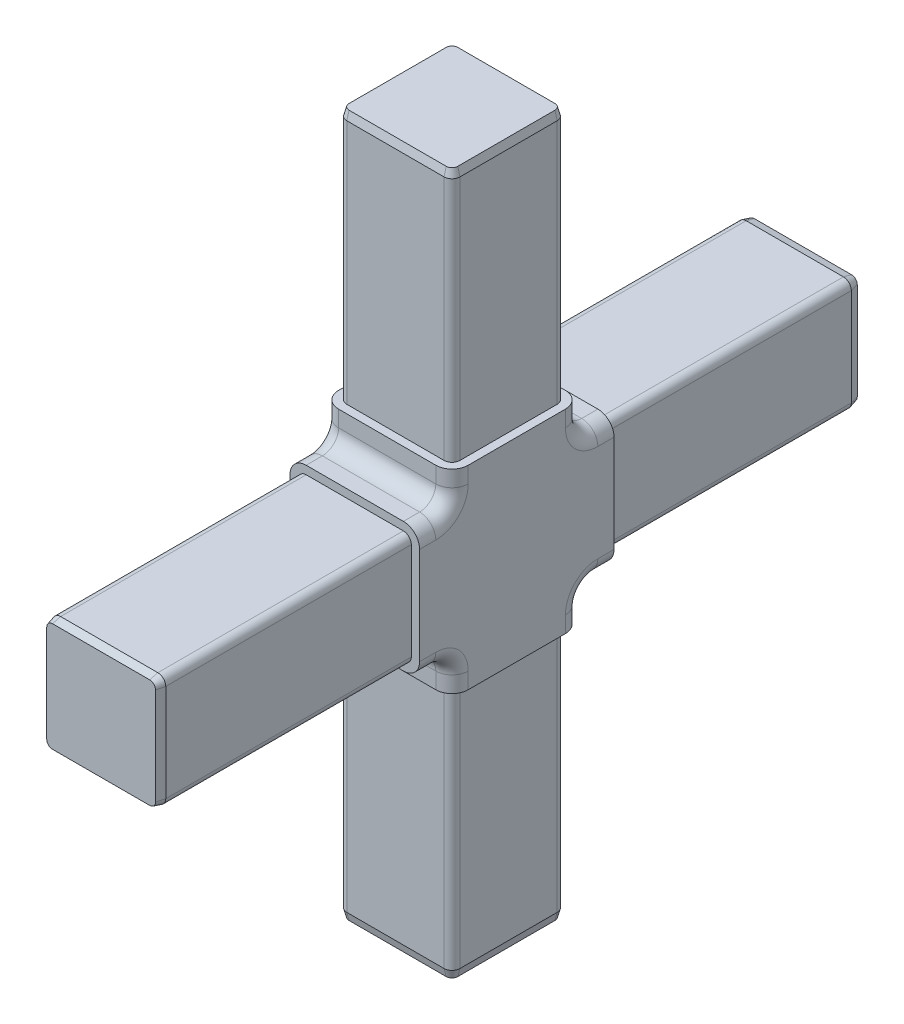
from build123d import *
from OCP.BRepFilletAPI import BRepFilletAPI_MakeChamfer

# Parameters (mm, degrees)
SKETCH5_W           = 203.2
SKETCH5_H           = 203.2
BOSS_EXTRUDE1_DEPTH = 550
SKETCH6_W           = 203.2
SKETCH6_H           = 203.2
BOSS_EXTRUDE2_DEPTH = 550
SKETCH7_W           = 377.884669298
SKETCH7_H           = 283.555750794
CUT_EXTRUDE1_DEPTH  = 898.879902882
SKETCH8_W           = 333.615448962
SKETCH8_H           = 339.173536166
CUT_EXTRUDE2_DEPTH  = 898.879902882
SKETCH9_W           = 367.625310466
SKETCH9_H           = 483.870467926
CUT_EXTRUDE3_DEPTH  = 898.879902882
SKETCH10_W          = 309.502731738
SKETCH10_H          = 361.813052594
CUT_EXTRUDE4_DEPTH  = 898.879902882
FILLET1_R           = 25.4
CHAMFER1_SIZE       = 12.7
CHAMFER1_SIZE2      = 3.402954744
CHAMFER2_SIZE       = 12.7
CHAMFER2_SIZE2      = 3.402954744


with BuildPart() as part:
    # Sketch5 → Boss-Extrude1 (new, symmetric)
    with BuildSketch(Plane(origin=(0, 0, 0), x_dir=(0, 1, 0), z_dir=(0, 0, 1))):
        Rectangle(SKETCH5_W, SKETCH5_H)
    extrude(amount=BOSS_EXTRUDE1_DEPTH, both=True)

    # Sketch6 → Boss-Extrude2 (add, symmetric)
    with BuildSketch(Plane(origin=(0, 0, 0), x_dir=(-1, 0, 0), z_dir=(0, 1, 0))):
        Rectangle(SKETCH6_W, SKETCH6_H)
    extrude(amount=BOSS_EXTRUDE2_DEPTH, both=True)

    # Sketch7 → Cut-Extrude1 (cut, through all)
    with BuildSketch(Plane(origin=(0, 152.4, 0), x_dir=(-1, 0, 0), z_dir=(0, 1, 0))):
        Rectangle(SKETCH7_W, SKETCH7_H)
        with BuildLine():
            Line((-88.646, 76.2), (-88.646, -76.2))
            ThreePointArc((-88.646, -76.2), (-85.000650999, -85.000650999), (-76.2, -88.646))
            Line((-76.2, -88.646), (76.2, -88.646))
            ThreePointArc((76.2, -88.646), (85.000650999, -85.000650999), (88.646, -76.2))
            Line((88.646, -76.2), (88.646, 76.2))
            ThreePointArc((88.646, 76.2), (85.000650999, 85.000650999), (76.2, 88.646))
            Line((76.2, 88.646), (-76.2, 88.646))
            ThreePointArc((-76.2, 88.646), (-85.000650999, 85.000650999), (-88.646, 76.2))
        make_face(mode=Mode.SUBTRACT)
    extrude(amount=CUT_EXTRUDE1_DEPTH, mode=Mode.SUBTRACT)

    # Sketch8 → Cut-Extrude2 (cut, through all)
    with BuildSketch(Plane(origin=(0, -152.4, 0), x_dir=(-1, 0, 0), z_dir=(0, 1, 0))):
        Rectangle(SKETCH8_W, SKETCH8_H)
        with BuildLine():
            Line((88.646, -76.2), (88.646, 76.2))
            ThreePointArc((88.646, 76.2), (85.000650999, 85.000650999), (76.2, 88.646))
            Line((76.2, 88.646), (-76.2, 88.646))
            ThreePointArc((-76.2, 88.646), (-85.000650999, 85.000650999), (-88.646, 76.2))
            Line((-88.646, 76.2), (-88.646, -76.2))
            ThreePointArc((-88.646, -76.2), (-85.000650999, -85.000650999), (-76.2, -88.646))
            Line((-76.2, -88.646), (76.2, -88.646))
            ThreePointArc((76.2, -88.646), (85.000650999, -85.000650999), (88.646, -76.2))
        make_face(mode=Mode.SUBTRACT)
    extrude(amount=-CUT_EXTRUDE2_DEPTH, mode=Mode.SUBTRACT)

    # Sketch9 → Cut-Extrude3 (cut, through all)
    with BuildSketch(Plane(origin=(0, 0, 152.4), x_dir=(0, 1, 0), z_dir=(0, 0, 1))):
        Rectangle(SKETCH9_W, SKETCH9_H)
        with BuildLine():
            Line((-88.646, 76.2), (-88.646, -76.2))
            ThreePointArc((-88.646, -76.2), (-85.000650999, -85.000650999), (-76.2, -88.646))
            Line((-76.2, -88.646), (76.2, -88.646))
            ThreePointArc((76.2, -88.646), (85.000650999, -85.000650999), (88.646, -76.2))
            Line((88.646, -76.2), (88.646, 76.2))
            ThreePointArc((88.646, 76.2), (85.000650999, 85.000650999), (76.2, 88.646))
            Line((76.2, 88.646), (-76.2, 88.646))
            ThreePointArc((-76.2, 88.646), (-85.000650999, 85.000650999), (-88.646, 76.2))
        make_face(mode=Mode.SUBTRACT)
    extrude(amount=CUT_EXTRUDE3_DEPTH, mode=Mode.SUBTRACT)

    # Sketch10 → Cut-Extrude4 (cut, through all)
    with BuildSketch(Plane(origin=(0, 0, -152.4), x_dir=(0, 1, 0), z_dir=(0, 0, 1))):
        Rectangle(SKETCH10_W, SKETCH10_H)
        with BuildLine():
            Line((-76.2, -88.646), (76.2, -88.646))
            ThreePointArc((76.2, -88.646), (85.000650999, -85.000650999), (88.646, -76.2))
            Line((88.646, -76.2), (88.646, 76.2))
            ThreePointArc((88.646, 76.2), (85.000650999, 85.000650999), (76.2, 88.646))
            Line((76.2, 88.646), (-76.2, 88.646))
            ThreePointArc((-76.2, 88.646), (-85.000650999, 85.000650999), (-88.646, 76.2))
            Line((-88.646, 76.2), (-88.646, -76.2))
            ThreePointArc((-88.646, -76.2), (-85.000650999, -85.000650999), (-76.2, -88.646))
        make_face(mode=Mode.SUBTRACT)
    extrude(amount=-CUT_EXTRUDE4_DEPTH, mode=Mode.SUBTRACT)

    # Fillet1
    fillet1_edges = [part.edges().sort_by_distance(p)[0] for p in [
        (101.6, -101.6, 127),
        (-101.6, -101.6, 127),
        (-101.6, 101.6, 127),
        (101.6, 101.6, 127),
        (101.6, 101.6, -127),
        (101.6, -101.6, -127),
        (-101.6, -101.6, -127),
        (-101.6, 101.6, -127),
        (-101.6, -127, -101.6),
        (101.6, -127, 101.6),
        (0, 101.6, 101.6),
        (0, -101.6, 101.6),
        (-101.6, -127, 101.6),
        (0, 101.6, -101.6),
        (0, -101.6, -101.6),
        (101.6, -127, -101.6),
        (101.6, 127, -101.6),
        (-101.6, 127, -101.6),
        (-101.6, 127, 101.6),
        (101.6, 127, 101.6),
    ]]
    fillet(fillet1_edges, radius=FILLET1_R)

    # Chamfer1: one chamfer whose edges measure the first distance from different faces: ONE call of the kernel's chamfer builder (chamfer() names one face for all edges)
    chamfer1_edges_1 = [part.edges().sort_by_distance(p)[0] for p in [
        (-85.000650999, -85.000650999, 550),
    ]]
    chamfer1_side_1 = [part.faces().sort_by_distance(p)[0] for p in [
        (-85.000650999, -85.000650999, 351.2),
    ]]
    chamfer1_edges_2 = [part.edges().sort_by_distance(p)[0] for p in [
        (0, -88.646, 550),
    ]]
    chamfer1_side_2 = [part.faces().sort_by_distance(p)[0] for p in [
        (0, -88.646, 351.2),
    ]]
    chamfer1_edges_3 = [part.edges().sort_by_distance(p)[0] for p in [
        (85.000650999, -85.000650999, 550),
    ]]
    chamfer1_side_3 = [part.faces().sort_by_distance(p)[0] for p in [
        (85.000650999, -85.000650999, 351.2),
    ]]
    chamfer1_edges_4 = [part.edges().sort_by_distance(p)[0] for p in [
        (88.646, 0, 550),
    ]]
    chamfer1_side_4 = [part.faces().sort_by_distance(p)[0] for p in [
        (88.646, 0, 351.2),
    ]]
    chamfer1_edges_5 = [part.edges().sort_by_distance(p)[0] for p in [
        (85.000650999, 85.000650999, 550),
    ]]
    chamfer1_side_5 = [part.faces().sort_by_distance(p)[0] for p in [
        (85.000650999, 85.000650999, 351.2),
    ]]
    chamfer1_edges_6 = [part.edges().sort_by_distance(p)[0] for p in [
        (0, 88.646, 550),
    ]]
    chamfer1_side_6 = [part.faces().sort_by_distance(p)[0] for p in [
        (0, 88.646, 351.2),
    ]]
    chamfer1_edges_7 = [part.edges().sort_by_distance(p)[0] for p in [
        (-85.000650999, 85.000650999, 550),
    ]]
    chamfer1_side_7 = [part.faces().sort_by_distance(p)[0] for p in [
        (-85.000650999, 85.000650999, 351.2),
    ]]
    chamfer1_edges_8 = [part.edges().sort_by_distance(p)[0] for p in [
        (-88.646, 0, 550),
    ]]
    chamfer1_side_8 = [part.faces().sort_by_distance(p)[0] for p in [
        (-88.646, 0, 351.2),
    ]]
    chamfer1_edges_9 = [part.edges().sort_by_distance(p)[0] for p in [
        (85.000650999, 550, 85.000650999),
    ]]
    chamfer1_side_9 = [part.faces().sort_by_distance(p)[0] for p in [
        (85.000650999, 351.2, 85.000650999),
    ]]
    chamfer1_edges_10 = [part.edges().sort_by_distance(p)[0] for p in [
        (88.646, 550, 0),
    ]]
    chamfer1_side_10 = [part.faces().sort_by_distance(p)[0] for p in [
        (88.646, 351.2, 0),
    ]]
    chamfer1_edges_11 = [part.edges().sort_by_distance(p)[0] for p in [
        (85.000650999, 550, -85.000650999),
    ]]
    chamfer1_side_11 = [part.faces().sort_by_distance(p)[0] for p in [
        (85.000650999, 351.2, -85.000650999),
    ]]
    chamfer1_edges_12 = [part.edges().sort_by_distance(p)[0] for p in [
        (0, 550, -88.646),
    ]]
    chamfer1_side_12 = [part.faces().sort_by_distance(p)[0] for p in [
        (0, 351.2, -88.646),
    ]]
    chamfer1_edges_13 = [part.edges().sort_by_distance(p)[0] for p in [
        (-85.000650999, 550, -85.000650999),
    ]]
    chamfer1_side_13 = [part.faces().sort_by_distance(p)[0] for p in [
        (-85.000650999, 351.2, -85.000650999),
    ]]
    chamfer1_edges_14 = [part.edges().sort_by_distance(p)[0] for p in [
        (-88.646, 550, 0),
    ]]
    chamfer1_side_14 = [part.faces().sort_by_distance(p)[0] for p in [
        (-88.646, 351.2, 0),
    ]]
    chamfer1_edges_15 = [part.edges().sort_by_distance(p)[0] for p in [
        (-85.000650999, 550, 85.000650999),
    ]]
    chamfer1_side_15 = [part.faces().sort_by_distance(p)[0] for p in [
        (-85.000650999, 351.2, 85.000650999),
    ]]
    chamfer1_edges_16 = [part.edges().sort_by_distance(p)[0] for p in [
        (0, 550, 88.646),
    ]]
    chamfer1_side_16 = [part.faces().sort_by_distance(p)[0] for p in [
        (0, 351.2, 88.646),
    ]]
    chamfer1 = BRepFilletAPI_MakeChamfer(part.part.solid().wrapped)
    for e in chamfer1_edges_1:
        chamfer1.Add(CHAMFER1_SIZE, CHAMFER1_SIZE2, e.wrapped, chamfer1_side_1[0].wrapped)  # the first distance lies on this face
    for e in chamfer1_edges_2:
        chamfer1.Add(CHAMFER1_SIZE, CHAMFER1_SIZE2, e.wrapped, chamfer1_side_2[0].wrapped)  # the first distance lies on this face
    for e in chamfer1_edges_3:
        chamfer1.Add(CHAMFER1_SIZE, CHAMFER1_SIZE2, e.wrapped, chamfer1_side_3[0].wrapped)  # the first distance lies on this face
    for e in chamfer1_edges_4:
        chamfer1.Add(CHAMFER1_SIZE, CHAMFER1_SIZE2, e.wrapped, chamfer1_side_4[0].wrapped)  # the first distance lies on this face
    for e in chamfer1_edges_5:
        chamfer1.Add(CHAMFER1_SIZE, CHAMFER1_SIZE2, e.wrapped, chamfer1_side_5[0].wrapped)  # the first distance lies on this face
    for e in chamfer1_edges_6:
        chamfer1.Add(CHAMFER1_SIZE, CHAMFER1_SIZE2, e.wrapped, chamfer1_side_6[0].wrapped)  # the first distance lies on this face
    for e in chamfer1_edges_7:
        chamfer1.Add(CHAMFER1_SIZE, CHAMFER1_SIZE2, e.wrapped, chamfer1_side_7[0].wrapped)  # the first distance lies on this face
    for e in chamfer1_edges_8:
        chamfer1.Add(CHAMFER1_SIZE, CHAMFER1_SIZE2, e.wrapped, chamfer1_side_8[0].wrapped)  # the first distance lies on this face
    for e in chamfer1_edges_9:
        chamfer1.Add(CHAMFER1_SIZE, CHAMFER1_SIZE2, e.wrapped, chamfer1_side_9[0].wrapped)  # the first distance lies on this face
    for e in chamfer1_edges_10:
        chamfer1.Add(CHAMFER1_SIZE, CHAMFER1_SIZE2, e.wrapped, chamfer1_side_10[0].wrapped)  # the first distance lies on this face
    for e in chamfer1_edges_11:
        chamfer1.Add(CHAMFER1_SIZE, CHAMFER1_SIZE2, e.wrapped, chamfer1_side_11[0].wrapped)  # the first distance lies on this face
    for e in chamfer1_edges_12:
        chamfer1.Add(CHAMFER1_SIZE, CHAMFER1_SIZE2, e.wrapped, chamfer1_side_12[0].wrapped)  # the first distance lies on this face
    for e in chamfer1_edges_13:
        chamfer1.Add(CHAMFER1_SIZE, CHAMFER1_SIZE2, e.wrapped, chamfer1_side_13[0].wrapped)  # the first distance lies on this face
    for e in chamfer1_edges_14:
        chamfer1.Add(CHAMFER1_SIZE, CHAMFER1_SIZE2, e.wrapped, chamfer1_side_14[0].wrapped)  # the first distance lies on this face
    for e in chamfer1_edges_15:
        chamfer1.Add(CHAMFER1_SIZE, CHAMFER1_SIZE2, e.wrapped, chamfer1_side_15[0].wrapped)  # the first distance lies on this face
    for e in chamfer1_edges_16:
        chamfer1.Add(CHAMFER1_SIZE, CHAMFER1_SIZE2, e.wrapped, chamfer1_side_16[0].wrapped)  # the first distance lies on this face
    add(Compound.cast(chamfer1.Shape()), mode=Mode.REPLACE)

    # Chamfer2: one chamfer whose edges measure the first distance from different faces: ONE call of the kernel's chamfer builder (chamfer() names one face for all edges)
    chamfer2_edges_1 = [part.edges().sort_by_distance(p)[0] for p in [
        (88.646, 0, -550),
    ]]
    chamfer2_side_1 = [part.faces().sort_by_distance(p)[0] for p in [
        (88.646, 0, -351.2),
    ]]
    chamfer2_edges_2 = [part.edges().sort_by_distance(p)[0] for p in [
        (85.000650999, 85.000650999, -550),
    ]]
    chamfer2_side_2 = [part.faces().sort_by_distance(p)[0] for p in [
        (85.000650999, 85.000650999, -351.2),
    ]]
    chamfer2_edges_3 = [part.edges().sort_by_distance(p)[0] for p in [
        (0, 88.646, -550),
    ]]
    chamfer2_side_3 = [part.faces().sort_by_distance(p)[0] for p in [
        (0, 88.646, -351.2),
    ]]
    chamfer2_edges_4 = [part.edges().sort_by_distance(p)[0] for p in [
        (-85.000650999, 85.000650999, -550),
    ]]
    chamfer2_side_4 = [part.faces().sort_by_distance(p)[0] for p in [
        (-85.000650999, 85.000650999, -351.2),
    ]]
    chamfer2_edges_5 = [part.edges().sort_by_distance(p)[0] for p in [
        (-88.646, 0, -550),
    ]]
    chamfer2_side_5 = [part.faces().sort_by_distance(p)[0] for p in [
        (-88.646, 0, -351.2),
    ]]
    chamfer2_edges_6 = [part.edges().sort_by_distance(p)[0] for p in [
        (-85.000650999, -85.000650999, -550),
    ]]
    chamfer2_side_6 = [part.faces().sort_by_distance(p)[0] for p in [
        (-85.000650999, -85.000650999, -351.2),
    ]]
    chamfer2_edges_7 = [part.edges().sort_by_distance(p)[0] for p in [
        (0, -88.646, -550),
    ]]
    chamfer2_side_7 = [part.faces().sort_by_distance(p)[0] for p in [
        (0, -88.646, -351.2),
    ]]
    chamfer2_edges_8 = [part.edges().sort_by_distance(p)[0] for p in [
        (85.000650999, -85.000650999, -550),
    ]]
    chamfer2_side_8 = [part.faces().sort_by_distance(p)[0] for p in [
        (85.000650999, -85.000650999, -351.2),
    ]]
    chamfer2_edges_9 = [part.edges().sort_by_distance(p)[0] for p in [
        (-88.646, -550, 0),
    ]]
    chamfer2_side_9 = [part.faces().sort_by_distance(p)[0] for p in [
        (-88.646, -351.2, 0),
    ]]
    chamfer2_edges_10 = [part.edges().sort_by_distance(p)[0] for p in [
        (-85.000650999, -550, 85.000650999),
    ]]
    chamfer2_side_10 = [part.faces().sort_by_distance(p)[0] for p in [
        (-85.000650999, -351.2, 85.000650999),
    ]]
    chamfer2_edges_11 = [part.edges().sort_by_distance(p)[0] for p in [
        (0, -550, 88.646),
    ]]
    chamfer2_side_11 = [part.faces().sort_by_distance(p)[0] for p in [
        (0, -351.2, 88.646),
    ]]
    chamfer2_edges_12 = [part.edges().sort_by_distance(p)[0] for p in [
        (85.000650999, -550, 85.000650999),
    ]]
    chamfer2_side_12 = [part.faces().sort_by_distance(p)[0] for p in [
        (85.000650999, -351.2, 85.000650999),
    ]]
    chamfer2_edges_13 = [part.edges().sort_by_distance(p)[0] for p in [
        (88.646, -550, 0),
    ]]
    chamfer2_side_13 = [part.faces().sort_by_distance(p)[0] for p in [
        (88.646, -351.2, 0),
    ]]
    chamfer2_edges_14 = [part.edges().sort_by_distance(p)[0] for p in [
        (85.000650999, -550, -85.000650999),
    ]]
    chamfer2_side_14 = [part.faces().sort_by_distance(p)[0] for p in [
        (85.000650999, -351.2, -85.000650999),
    ]]
    chamfer2_edges_15 = [part.edges().sort_by_distance(p)[0] for p in [
        (0, -550, -88.646),
    ]]
    chamfer2_side_15 = [part.faces().sort_by_distance(p)[0] for p in [
        (0, -351.2, -88.646),
    ]]
    chamfer2_edges_16 = [part.edges().sort_by_distance(p)[0] for p in [
        (-85.000650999, -550, -85.000650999),
    ]]
    chamfer2_side_16 = [part.faces().sort_by_distance(p)[0] for p in [
        (-85.000650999, -351.2, -85.000650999),
    ]]
    chamfer2 = BRepFilletAPI_MakeChamfer(part.part.solid().wrapped)
    for e in chamfer2_edges_1:
        chamfer2.Add(CHAMFER2_SIZE, CHAMFER2_SIZE2, e.wrapped, chamfer2_side_1[0].wrapped)  # the first distance lies on this face
    for e in chamfer2_edges_2:
        chamfer2.Add(CHAMFER2_SIZE, CHAMFER2_SIZE2, e.wrapped, chamfer2_side_2[0].wrapped)  # the first distance lies on this face
    for e in chamfer2_edges_3:
        chamfer2.Add(CHAMFER2_SIZE, CHAMFER2_SIZE2, e.wrapped, chamfer2_side_3[0].wrapped)  # the first distance lies on this face
    for e in chamfer2_edges_4:
        chamfer2.Add(CHAMFER2_SIZE, CHAMFER2_SIZE2, e.wrapped, chamfer2_side_4[0].wrapped)  # the first distance lies on this face
    for e in chamfer2_edges_5:
        chamfer2.Add(CHAMFER2_SIZE, CHAMFER2_SIZE2, e.wrapped, chamfer2_side_5[0].wrapped)  # the first distance lies on this face
    for e in chamfer2_edges_6:
        chamfer2.Add(CHAMFER2_SIZE, CHAMFER2_SIZE2, e.wrapped, chamfer2_side_6[0].wrapped)  # the first distance lies on this face
    for e in chamfer2_edges_7:
        chamfer2.Add(CHAMFER2_SIZE, CHAMFER2_SIZE2, e.wrapped, chamfer2_side_7[0].wrapped)  # the first distance lies on this face
    for e in chamfer2_edges_8:
        chamfer2.Add(CHAMFER2_SIZE, CHAMFER2_SIZE2, e.wrapped, chamfer2_side_8[0].wrapped)  # the first distance lies on this face
    for e in chamfer2_edges_9:
        chamfer2.Add(CHAMFER2_SIZE, CHAMFER2_SIZE2, e.wrapped, chamfer2_side_9[0].wrapped)  # the first distance lies on this face
    for e in chamfer2_edges_10:
        chamfer2.Add(CHAMFER2_SIZE, CHAMFER2_SIZE2, e.wrapped, chamfer2_side_10[0].wrapped)  # the first distance lies on this face
    for e in chamfer2_edges_11:
        chamfer2.Add(CHAMFER2_SIZE, CHAMFER2_SIZE2, e.wrapped, chamfer2_side_11[0].wrapped)  # the first distance lies on this face
    for e in chamfer2_edges_12:
        chamfer2.Add(CHAMFER2_SIZE, CHAMFER2_SIZE2, e.wrapped, chamfer2_side_12[0].wrapped)  # the first distance lies on this face
    for e in chamfer2_edges_13:
        chamfer2.Add(CHAMFER2_SIZE, CHAMFER2_SIZE2, e.wrapped, chamfer2_side_13[0].wrapped)  # the first distance lies on this face
    for e in chamfer2_edges_14:
        chamfer2.Add(CHAMFER2_SIZE, CHAMFER2_SIZE2, e.wrapped, chamfer2_side_14[0].wrapped)  # the first distance lies on this face
    for e in chamfer2_edges_15:
        chamfer2.Add(CHAMFER2_SIZE, CHAMFER2_SIZE2, e.wrapped, chamfer2_side_15[0].wrapped)  # the first distance lies on this face
    for e in chamfer2_edges_16:
        chamfer2.Add(CHAMFER2_SIZE, CHAMFER2_SIZE2, e.wrapped, chamfer2_side_16[0].wrapped)  # the first distance lies on this face
    add(Compound.cast(chamfer2.Shape()), mode=Mode.REPLACE)


solid = part.part
